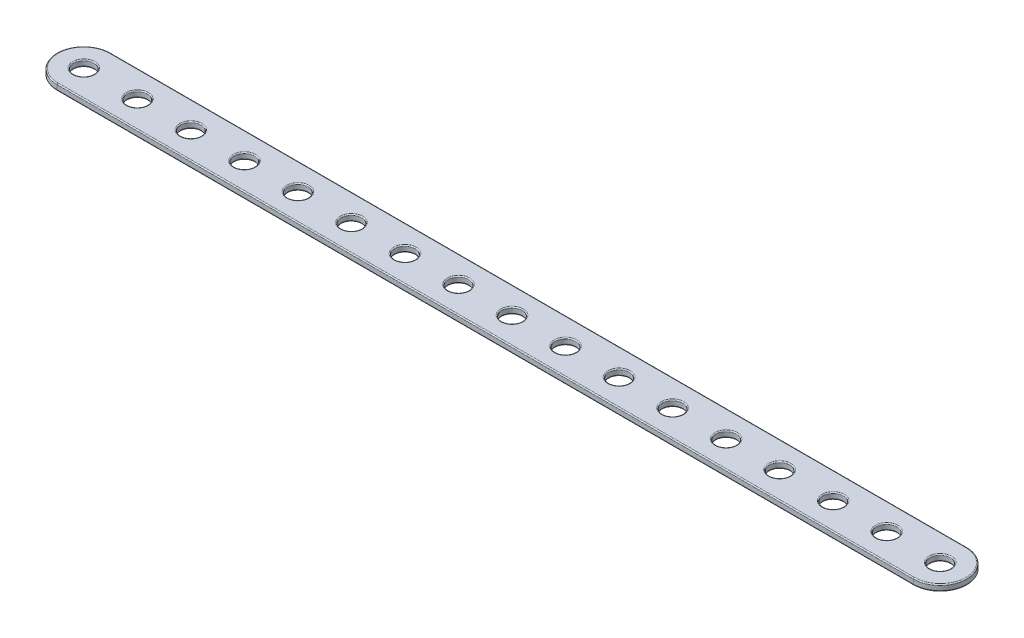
from build123d import *

# Parameters (mm, degrees)
EXTRUDE1_DEPTH     = 1.524
SKETCH2_R          = 2.413
CUT_EXTRUDE1_DEPTH = 210.940027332
LPATTERN1_COUNT    = 17
LPATTERN1_PITCH    = 12.7
FILLET1_R          = 0.254


with BuildPart() as part:
    # Sketch1 → Extrude1 (new body)
    with BuildSketch(Plane(origin=(0, 0, 0), x_dir=(1, 0, 0), z_dir=(0, 1, 0))):
        with BuildLine():
            Line((0, 0), (203.2, 0))
            ThreePointArc((203.2, 0), (209.55, 6.35), (203.2, 12.7))
            Line((203.2, 12.7), (0, 12.7))
            ThreePointArc((0, 12.7), (-6.35, 6.35), (0, 0))
        make_face()
    extrude(amount=EXTRUDE1_DEPTH)

    # Sketch2 → Cut-Extrude1 (cut, through all)
    with BuildSketch(Plane(origin=(0, 1.524, 0), x_dir=(-1, 0, 0), z_dir=(0, 1, 0))):
        with Locations(Location((0, -6.35, 0), (0, 0, 90))):
            Circle(SKETCH2_R)
    cut_extrude1 = extrude(amount=-CUT_EXTRUDE1_DEPTH, mode=Mode.SUBTRACT)

    # LPattern1: Cut-Extrude1 ×17
    with Locations(*[(i * LPATTERN1_PITCH, 0, 0) for i in range(1, LPATTERN1_COUNT)]):
        add(cut_extrude1, mode=Mode.SUBTRACT)

    # Fillet1
    fillet1_edges = [part.edges().sort_by_distance(p)[0] for p in [
        (209.55, 1.524, -6.35),
        (101.6, 1.524, -12.7),
        (0, 0, -8.763),
        (0, 1.524, -8.763),
        (12.7, 0, -8.763),
        (12.7, 1.524, -8.763),
        (25.4, 0, -8.763),
        (25.4, 1.524, -8.763),
        (38.1, 0, -8.763),
        (38.1, 1.524, -8.763),
        (50.8, 0, -8.763),
        (50.8, 1.524, -8.763),
        (63.5, 0, -8.763),
        (63.5, 1.524, -8.763),
        (76.2, 0, -8.763),
        (76.2, 1.524, -8.763),
        (-6.35, 1.524, -6.35),
        (101.6, 0, -12.7),
        (88.9, 0, -8.763),
        (88.9, 1.524, -8.763),
        (209.55, 0, -6.35),
        (101.6, 0, -8.763),
        (101.6, 1.524, -8.763),
        (101.6, 0, 0),
        (114.3, 0, -8.763),
        (114.3, 1.524, -8.763),
        (127, 0, -8.763),
        (-6.35, 0, -6.35),
        (127, 1.524, -8.763),
        (139.7, 0, -8.763),
        (139.7, 1.524, -8.763),
        (152.4, 0, -8.763),
        (152.4, 1.524, -8.763),
        (165.1, 0, -8.763),
        (165.1, 1.524, -8.763),
        (177.8, 0, -8.763),
        (177.8, 1.524, -8.763),
        (101.6, 1.524, 0),
        (190.5, 0, -8.763),
        (190.5, 1.524, -8.763),
        (203.2, 0, -8.763),
        (203.2, 1.524, -8.763),
    ]]
    fillet(fillet1_edges, radius=FILLET1_R)


solid = part.part
